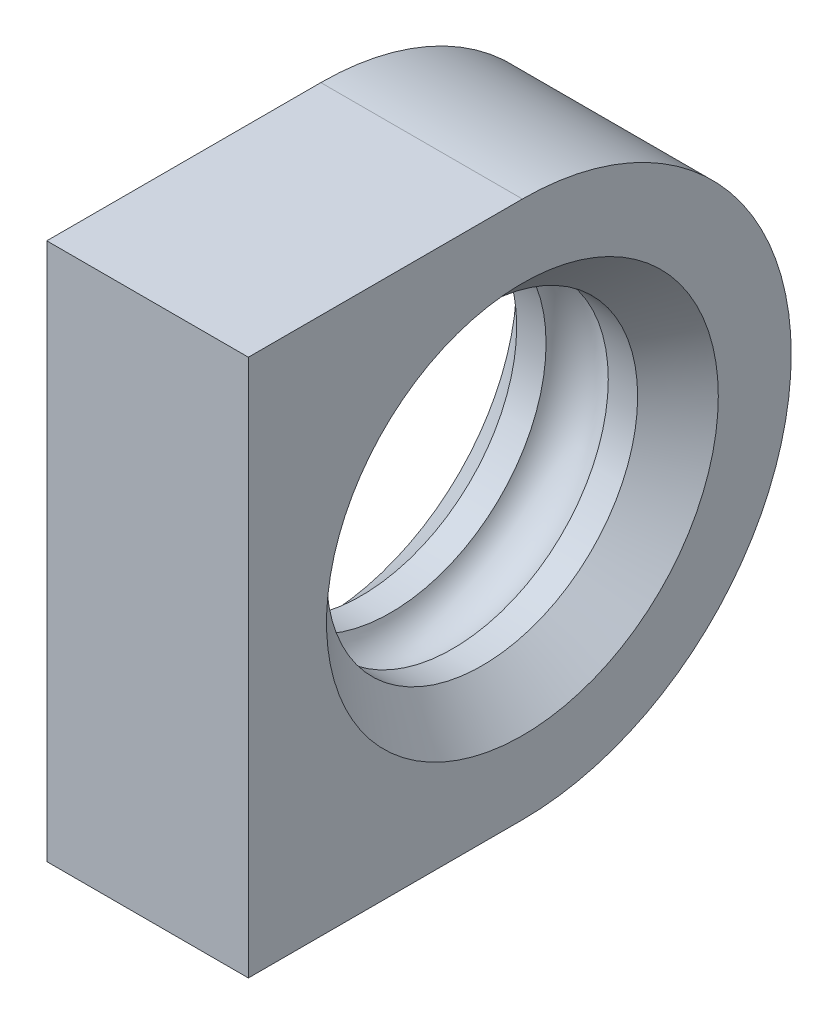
from build123d import *

# Parameters (mm, degrees)
SKETCH1_R               = 3.675
BOSS_EXTRUDE1_DEPTH     = 4.7625
CHAMFER1_SIZE           = 0.9525
SKETCH2_R               = 0.79375
SKETCH4_W               = 0.915865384
SKETCH4_H               = 0.244230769
SKETCH4_W_2             = 0.915865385
BOSS_EXTRUDE2_DEPTH     = 0.2
CUT_EXTRUDE3_DEPTH      = 57.906295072
CUT_EXTRUDE3_DEPTH_BACK = 57.906295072
SKETCH5_W               = 69.568425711
SKETCH5_H               = 50.937494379


with BuildPart() as part:
    # Sketch1 → Boss-Extrude1 (new body)
    with BuildSketch(Plane(origin=(0, 0, 0), x_dir=(0, 0, -1), z_dir=(1, 0, 0))):
        with BuildLine():
            Line((0, 6.35), (50, 6.35))
            ThreePointArc((50, 6.35), (56.35, 0), (50, -6.35))
            Line((50, -6.35), (0, -6.35))
            ThreePointArc((0, -6.35), (-6.35, 0), (0, 6.35))
        make_face()
        with Locations(Location((0, 0, 0), (0, 0, 180))):
            Circle(SKETCH1_R, mode=Mode.SUBTRACT)
        with Locations(Location((50, 0, 0), (0, 0, 180))):
            Circle(SKETCH1_R, mode=Mode.SUBTRACT)
    extrude(amount=BOSS_EXTRUDE1_DEPTH)

    # Chamfer1
    chamfer1_edges = [part.edges().sort_by_distance(p)[0] for p in [
        (0, 0, -3.675),
        (0, 0, -53.675),
        (4.7625, 0, -3.675),
        (4.7625, 0, -53.675),
    ]]
    chamfer(chamfer1_edges, length=CHAMFER1_SIZE)

    # Sketch2 → Cut-Revolve1 (revolve, cut)
    with BuildSketch(Plane(origin=(0, 0, 0), x_dir=(1, 0, 0), z_dir=(0, 1, 0))):
        with Locations((2.38125, -3.375)):
            Circle(SKETCH2_R)
    cut_revolve1 = revolve(axis=Axis((0.4525, 0, 0), (1, 0, 0)), mode=Mode.SUBTRACT)

    # Sketch-Pattern2: Cut-Revolve1 at 1 more place
    with Locations((0, 0, -50)):
        add(cut_revolve1, mode=Mode.SUBTRACT)

    # Sketch4 → Boss-Extrude2 (add)
    # profile 1 of 12: a face of its own
    with BuildSketch(Plane.ZY):
        Polygon((-33.757883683, -1.001090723), (-33.757883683, -1.235781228), (-35.406441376, -0.451571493), (-35.406441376, -0.279846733), (-33.757883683, 0.504363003), (-33.757883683, 0.269672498), (-35.093997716, -0.365709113), align=None)
    # profile 2 of 12: a face of its own
    with BuildSketch(Plane.ZY):
        with Locations((-33.055720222, -0.625204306)):
            Rectangle(SKETCH4_W, SKETCH4_H)
    # profile 3 of 12: a face of its own
    with BuildSketch(Plane.ZY):
        with Locations((-31.956681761, -0.625204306)):
            Rectangle(SKETCH4_W_2, SKETCH4_H)
    # profile 4 of 12: a face of its own
    with BuildSketch(Plane.ZY):
        with Locations((-30.857643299, -0.625204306)):
            Rectangle(SKETCH4_W_2, SKETCH4_H)
    # profile 5 of 12: a face of its own
    with BuildSketch(Plane.ZY):
        with BuildLine():
            Line((-28.720624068, 0.84018031), (-28.720624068, 0.595949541))
            Line((-28.720624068, 0.595949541), (-29.530115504, 0.595949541))
            Line((-29.530115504, 0.595949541), (-29.658909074, -0.030368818))
            add(Edge.make_bspline(
                [(-29.658909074, -0.030368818), (-29.633697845, -0.02340858), (-29.584855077, -0.009924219), (-29.512764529, 0.005047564), (-29.444325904, 0.014072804), (-29.39991534, 0.015305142), (-29.3784253, 0.015901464)],
                knots=[0, 0, 0, 0, 1.100273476, 2.13160584, 3.095893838, 4, 4, 4, 4], degree=3))
            add(Edge.make_bspline(
                [(-29.3784253, 0.015901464), (-29.351834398, 0.015325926), (-29.299550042, 0.014194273), (-29.223051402, 0.003327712), (-29.150026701, -0.013776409), (-29.08062866, -0.037670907), (-29.014728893, -0.068225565), (-28.952933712, -0.10639356), (-28.894315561, -0.15097963), (-28.839926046, -0.202241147), (-28.790583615, -0.258657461), (-28.747199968, -0.319316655), (-28.710350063, -0.383629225), (-28.680713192, -0.45220964), (-28.657047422, -0.524299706), (-28.641295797, -0.600657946), (-28.630806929, -0.680564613), (-28.629635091, -0.735200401), (-28.62903753, -0.763061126)],
                knots=[0, 0, 0, 0, 1.052922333, 2.070308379, 3.05430497, 4.020497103, 4.973039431, 5.925935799, 6.892292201, 7.88610001, 8.88166317, 9.857072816, 10.836096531, 11.812156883, 12.81219415, 13.836441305, 14.89672472, 16, 16, 16, 16], degree=3))
            add(Edge.make_bspline(
                [(-28.62903753, -0.763061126), (-28.629490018, -0.782466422), (-28.630388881, -0.821014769), (-28.63495992, -0.878262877), (-28.643760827, -0.934299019), (-28.655577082, -0.989130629), (-28.670913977, -1.042653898), (-28.68948028, -1.095022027), (-28.712201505, -1.145909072), (-28.737123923, -1.195796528), (-28.765186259, -1.243556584), (-28.796331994, -1.288221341), (-28.829237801, -1.330460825), (-28.864644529, -1.369822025), (-28.902881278, -1.406046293), (-28.94348497, -1.439348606), (-28.986131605, -1.470292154), (-29.031480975, -1.497620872), (-29.078522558, -1.522768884), (-29.127935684, -1.543399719), (-29.178595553, -1.56184456), (-29.231231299, -1.576546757), (-29.285723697, -1.588066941), (-29.342162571, -1.595891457), (-29.400251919, -1.601590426), (-29.439627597, -1.601947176), (-29.459517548, -1.602127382)],
                knots=[0, 0, 0, 0, 1.056347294, 2.098418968, 3.122841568, 4.141288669, 5.149314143, 6.15115421, 7.162517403, 8.180376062, 9.185164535, 10.17417709, 11.141909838, 12.097768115, 13.052685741, 14.0056014, 14.954263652, 15.917497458, 16.885230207, 17.854509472, 18.828990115, 19.81800267, 20.826176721, 21.857883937, 22.917946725, 24, 24, 24, 24], degree=3))
            add(Edge.make_bspline(
                [(-29.459517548, -1.602127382), (-29.483244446, -1.601657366), (-29.529924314, -1.600732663), (-29.5983142, -1.591059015), (-29.664114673, -1.577204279), (-29.726796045, -1.556360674), (-29.786920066, -1.530243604), (-29.843677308, -1.497235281), (-29.898518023, -1.459829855), (-29.94921282, -1.415688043), (-29.996263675, -1.367440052), (-30.038382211, -1.315081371), (-30.075892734, -1.259476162), (-30.108194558, -1.200354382), (-30.135747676, -1.137871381), (-30.15739323, -1.071793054), (-30.174863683, -1.002464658), (-30.182254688, -0.954735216), (-30.186008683, -0.930492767)],
                knots=[0, 0, 0, 0, 1.0467383, 2.05933395, 3.04377827, 4.011590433, 4.970194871, 5.932262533, 6.905835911, 7.896367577, 8.894135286, 9.877477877, 10.858688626, 11.851381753, 12.8477658, 13.868841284, 14.917554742, 16, 16, 16, 16], degree=3))
            Line((-30.186008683, -0.930492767), (-29.97230676, -0.930492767))
            add(Edge.make_bspline(
                [(-29.97230676, -0.930492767), (-29.967048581, -0.953200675), (-29.956942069, -0.996846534), (-29.934758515, -1.058168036), (-29.907635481, -1.112813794), (-29.875383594, -1.161506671), (-29.836909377, -1.203967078), (-29.793006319, -1.241806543), (-29.743784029, -1.275943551), (-29.689087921, -1.304397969), (-29.631384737, -1.32866546), (-29.570991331, -1.344825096), (-29.509552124, -1.356187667), (-29.467997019, -1.357325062), (-29.447115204, -1.357896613)],
                knots=[0, 0, 0, 0, 1.136247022, 2.183929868, 3.172523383, 4.106158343, 5.02341133, 5.958108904, 6.928429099, 7.938127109, 8.96079061, 9.975095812, 10.982467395, 12, 12, 12, 12], degree=3))
            add(Edge.make_bspline(
                [(-29.447115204, -1.357896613), (-29.426732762, -1.357338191), (-29.386599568, -1.356238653), (-29.327536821, -1.347775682), (-29.270514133, -1.334741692), (-29.216094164, -1.315235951), (-29.163324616, -1.291529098), (-29.113540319, -1.261106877), (-29.06530104, -1.226095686), (-29.020106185, -1.185984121), (-28.978713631, -1.141781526), (-28.94214027, -1.094512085), (-28.911675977, -1.044086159), (-28.886003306, -0.991376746), (-28.86650883, -0.935806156), (-28.852601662, -0.877634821), (-28.844435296, -0.816719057), (-28.843311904, -0.775170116), (-28.842739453, -0.753997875)],
                knots=[0, 0, 0, 0, 1.027316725, 2.022795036, 3.002884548, 3.971462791, 4.93288096, 5.914575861, 6.907176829, 7.935150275, 8.956128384, 9.956726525, 10.942570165, 11.921478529, 12.907843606, 13.90538589, 14.932640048, 16, 16, 16, 16], degree=3))
            add(Edge.make_bspline(
                [(-28.842739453, -0.753997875), (-28.843187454, -0.734896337), (-28.844064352, -0.697507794), (-28.851228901, -0.642807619), (-28.863690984, -0.591050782), (-28.880988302, -0.541987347), (-28.902949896, -0.495571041), (-28.929787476, -0.451753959), (-28.962004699, -0.411113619), (-28.998806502, -0.373631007), (-29.039123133, -0.339038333), (-29.083648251, -0.309548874), (-29.131450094, -0.284740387), (-29.181952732, -0.26333091), (-29.236357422, -0.247954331), (-29.293586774, -0.236410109), (-29.354258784, -0.229732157), (-29.395740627, -0.228805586), (-29.417063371, -0.228329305)],
                knots=[0, 0, 0, 0, 1.045622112, 2.046656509, 3.013763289, 3.955457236, 4.890082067, 5.820317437, 6.762574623, 7.722996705, 8.69280354, 9.665887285, 10.63943826, 11.638615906, 12.663482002, 13.728887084, 14.832589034, 16, 16, 16, 16], degree=3))
            add(Edge.make_bspline(
                [(-29.417063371, -0.228329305), (-29.435520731, -0.228724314), (-29.473630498, -0.229539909), (-29.532088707, -0.235545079), (-29.593519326, -0.245232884), (-29.657686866, -0.258558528), (-29.724784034, -0.275996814), (-29.794669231, -0.296893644), (-29.867489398, -0.321877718), (-29.916555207, -0.340745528), (-29.941777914, -0.35044469)],
                knots=[0, 0, 0, 0, 0.817624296, 1.688186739, 2.600797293, 3.572016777, 4.590301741, 5.671205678, 6.80286297, 8, 8, 8, 8], degree=3))
            Line((-29.941777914, -0.35044469), (-29.697547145, 0.84018031))
            Line((-29.697547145, 0.84018031), (-28.720624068, 0.84018031))
        make_face()
    # profile 6 of 12: a face of its own
    with BuildSketch(Plane.ZY):
        with BuildLine():
            add(Edge.make_bspline(
                [(-28.38480676, -0.351398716), (-28.384583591, -0.313232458), (-28.384150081, -0.239093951), (-28.379327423, -0.131063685), (-28.371315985, -0.029717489), (-28.360336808, 0.06494949), (-28.346975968, 0.152961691), (-28.329140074, 0.234083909), (-28.308856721, 0.308691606), (-28.285348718, 0.377028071), (-28.258823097, 0.440013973), (-28.229952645, 0.498813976), (-28.197591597, 0.553339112), (-28.163589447, 0.604459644), (-28.126569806, 0.651338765), (-28.087586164, 0.694638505), (-28.045116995, 0.733358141), (-28.000605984, 0.768632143), (-27.953650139, 0.799554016), (-27.905587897, 0.826790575), (-27.856088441, 0.850058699), (-27.805016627, 0.868353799), (-27.752831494, 0.883465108), (-27.699350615, 0.893799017), (-27.644485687, 0.900301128), (-27.607452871, 0.900922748), (-27.588671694, 0.901238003)],
                knots=[0, 0, 0, 0, 1.646270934, 3.197905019, 4.663502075, 6.030701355, 7.308322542, 8.50163776, 9.611534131, 10.641858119, 11.616356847, 12.558055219, 13.465016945, 14.349605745, 15.204443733, 16.039544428, 16.859896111, 17.680448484, 18.487036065, 19.28249412, 20.06191084, 20.843045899, 21.620316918, 22.403196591, 23.190181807, 24, 24, 24, 24], degree=3))
            add(Edge.make_bspline(
                [(-27.588671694, 0.901238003), (-27.569733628, 0.900906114), (-27.532071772, 0.900246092), (-27.476391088, 0.893902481), (-27.421996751, 0.883376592), (-27.36912066, 0.8684625), (-27.317328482, 0.849959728), (-27.267025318, 0.826768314), (-27.217898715, 0.799772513), (-27.170729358, 0.768051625), (-27.124999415, 0.732685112), (-27.08183214, 0.692705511), (-27.041223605, 0.648516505), (-27.002664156, 0.60059088), (-26.967247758, 0.548009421), (-26.93352012, 0.49168666), (-26.903331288, 0.430637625), (-26.874256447, 0.365880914), (-26.849160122, 0.295624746), (-26.826527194, 0.22026515), (-26.808239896, 0.138911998), (-26.793007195, 0.051992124), (-26.781206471, -0.040813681), (-26.772611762, -0.139306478), (-26.768071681, -0.243551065), (-26.767216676, -0.314823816), (-26.766777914, -0.351398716)],
                knots=[0, 0, 0, 0, 0.810914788, 1.612654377, 2.396697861, 3.181598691, 3.963628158, 4.749916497, 5.551656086, 6.361998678, 7.18212741, 8.025565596, 8.878627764, 9.750805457, 10.657531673, 11.591944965, 12.560506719, 13.57287815, 14.630710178, 15.753379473, 16.941251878, 18.199788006, 19.531962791, 20.947069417, 22.433333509, 24, 24, 24, 24], degree=3))
            add(Edge.make_bspline(
                [(-26.766777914, -0.351398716), (-26.767221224, -0.387814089), (-26.768084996, -0.458767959), (-26.772560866, -0.562543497), (-26.781377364, -0.660513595), (-26.792405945, -0.752913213), (-26.807680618, -0.839357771), (-26.82646199, -0.920146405), (-26.847315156, -0.995627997), (-26.873056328, -1.065184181), (-26.901230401, -1.129785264), (-26.931884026, -1.190110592), (-26.964724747, -1.246693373), (-27.000503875, -1.299080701), (-27.038640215, -1.34764368), (-27.079949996, -1.391525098), (-27.123268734, -1.431782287), (-27.169133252, -1.467604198), (-27.217038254, -1.498958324), (-27.265996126, -1.526998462), (-27.316875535, -1.549608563), (-27.368523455, -1.569022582), (-27.421678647, -1.583854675), (-27.476274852, -1.594110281), (-27.532034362, -1.601302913), (-27.569727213, -1.601851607), (-27.588671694, -1.602127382)],
                knots=[0, 0, 0, 0, 1.561518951, 3.042555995, 4.452378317, 5.7783523, 7.031515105, 8.214008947, 9.334062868, 10.386615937, 11.391082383, 12.354592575, 13.286541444, 14.194233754, 15.072674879, 15.931287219, 16.775624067, 17.606195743, 18.42308326, 19.229000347, 20.022332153, 20.807536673, 21.593273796, 22.3848459, 23.188221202, 24, 24, 24, 24], degree=3))
            add(Edge.make_bspline(
                [(-27.588671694, -1.602127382), (-27.60745235, -1.601810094), (-27.644484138, -1.601184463), (-27.699356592, -1.594711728), (-27.752616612, -1.584305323), (-27.804527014, -1.569734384), (-27.855354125, -1.551898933), (-27.904405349, -1.52866223), (-27.952226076, -1.501901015), (-27.998688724, -1.47142413), (-28.042920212, -1.436507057), (-28.085169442, -1.397887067), (-28.124375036, -1.354600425), (-28.160865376, -1.307330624), (-28.195545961, -1.256512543), (-28.227447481, -1.201452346), (-28.256955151, -1.142368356), (-28.283926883, -1.078878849), (-28.307840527, -1.010057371), (-28.328964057, -0.935116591), (-28.345642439, -0.85339506), (-28.359918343, -0.765549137), (-28.371432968, -0.671201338), (-28.379294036, -0.570300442), (-28.38415268, -0.462909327), (-28.384584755, -0.389247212), (-28.38480676, -0.351398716)],
                knots=[0, 0, 0, 0, 0.810891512, 1.598919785, 2.382837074, 3.152667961, 3.926044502, 4.706494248, 5.493654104, 6.291793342, 7.103789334, 7.925228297, 8.761435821, 9.622817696, 10.50288917, 11.416980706, 12.369136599, 13.353924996, 14.394355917, 15.514179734, 16.714354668, 17.994756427, 19.357759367, 20.818452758, 22.365282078, 24, 24, 24, 24], degree=3))
        make_face()
        with BuildLine():
            add(Edge.make_bspline(
                [(-28.171104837, -0.35044469), (-28.171023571, -0.382250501), (-28.170865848, -0.443979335), (-28.166745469, -0.533679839), (-28.161132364, -0.617343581), (-28.153892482, -0.695076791), (-28.143140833, -0.766616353), (-28.131093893, -0.832454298), (-28.116433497, -0.892242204), (-28.099087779, -0.946390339), (-28.079330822, -0.995817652), (-28.057759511, -1.041810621), (-28.034586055, -1.084912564), (-28.008651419, -1.124736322), (-27.980406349, -1.161411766), (-27.950488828, -1.195588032), (-27.917782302, -1.226065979), (-27.872536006, -1.262619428), (-27.812803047, -1.300392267), (-27.73754163, -1.333284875), (-27.660206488, -1.353955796), (-27.607716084, -1.35658453), (-27.581516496, -1.357896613)],
                knots=[0, 0, 0, 0, 1.459021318, 2.831673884, 4.118529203, 5.306027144, 6.411944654, 7.436330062, 8.375795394, 9.233974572, 10.042671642, 10.816086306, 11.563610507, 12.285937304, 12.993564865, 13.685989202, 14.367179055, 15.041617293, 16.353048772, 17.594441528, 18.799311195, 20, 20, 20, 20], degree=3))
            add(Edge.make_bspline(
                [(-27.581516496, -1.357896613), (-27.555147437, -1.356809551), (-27.502463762, -1.354637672), (-27.425492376, -1.333683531), (-27.350768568, -1.302067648), (-27.292208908, -1.264683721), (-27.247657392, -1.229081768), (-27.215737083, -1.198727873), (-27.18643951, -1.164740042), (-27.158652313, -1.128069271), (-27.133166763, -1.088014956), (-27.109991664, -1.044769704), (-27.088843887, -0.998213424), (-27.076795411, -0.965712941), (-27.070635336, -0.949096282)],
                knots=[0, 0, 0, 0, 1.353760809, 2.704726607, 4.075137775, 5.516104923, 6.260822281, 7.007110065, 7.778089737, 8.566572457, 9.372053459, 10.217411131, 11.088608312, 12, 12, 12, 12], degree=3))
            add(Edge.make_bspline(
                [(-27.070635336, -0.949096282), (-27.063456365, -0.927848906), (-27.048879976, -0.88470762), (-27.030094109, -0.817785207), (-27.015299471, -0.747570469), (-27.001989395, -0.674483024), (-26.992904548, -0.59798387), (-26.985592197, -0.518309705), (-26.981285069, -0.435400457), (-26.980751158, -0.379070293), (-26.980479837, -0.35044469)],
                knots=[0, 0, 0, 0, 0.884706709, 1.796334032, 2.740027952, 3.714592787, 4.726048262, 5.777819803, 6.87074269, 8, 8, 8, 8], degree=3))
            add(Edge.make_bspline(
                [(-26.980479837, -0.35044469), (-26.980854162, -0.321823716), (-26.981586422, -0.265834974), (-26.984385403, -0.183839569), (-26.991613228, -0.10596061), (-26.999640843, -0.031862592), (-27.011477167, 0.03804431), (-27.024239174, 0.104345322), (-27.041384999, 0.166219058), (-27.05970006, 0.224634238), (-27.080662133, 0.278927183), (-27.103736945, 0.329351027), (-27.128380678, 0.376149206), (-27.155147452, 0.419193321), (-27.183719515, 0.458676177), (-27.21485099, 0.493806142), (-27.247307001, 0.525672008), (-27.292766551, 0.562045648), (-27.352280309, 0.59913307), (-27.426334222, 0.633263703), (-27.503398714, 0.65286363), (-27.55549601, 0.655627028), (-27.581516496, 0.657007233)],
                knots=[0, 0, 0, 0, 1.31362396, 2.569729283, 3.763502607, 4.902122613, 5.988968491, 7.01645872, 7.998833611, 8.933434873, 9.825090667, 10.667526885, 11.477055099, 12.250526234, 12.991942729, 13.710640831, 14.402115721, 15.076753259, 16.378508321, 17.609869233, 18.806226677, 20, 20, 20, 20], degree=3))
            add(Edge.make_bspline(
                [(-27.581516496, 0.657007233), (-27.607853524, 0.655625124), (-27.660575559, 0.652858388), (-27.738441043, 0.633336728), (-27.813079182, 0.599310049), (-27.872435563, 0.56192281), (-27.917926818, 0.526314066), (-27.949959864, 0.495435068), (-27.979995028, 0.461657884), (-28.007663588, 0.424645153), (-28.033577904, 0.384867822), (-28.057377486, 0.342012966), (-28.078820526, 0.295863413), (-28.098608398, 0.246458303), (-28.116007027, 0.192314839), (-28.130358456, 0.132600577), (-28.143616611, 0.06697204), (-28.153002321, -0.004954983), (-28.161346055, -0.082707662), (-28.166708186, -0.166580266), (-28.170879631, -0.25643121), (-28.171028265, -0.318479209), (-28.171104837, -0.35044469)],
                knots=[0, 0, 0, 0, 1.207732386, 2.417664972, 3.655092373, 4.956220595, 5.625982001, 6.301752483, 6.994047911, 7.697131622, 8.419323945, 9.170223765, 9.943494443, 10.752040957, 11.610060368, 12.549350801, 13.567764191, 14.679664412, 15.874934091, 17.154273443, 18.533957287, 20, 20, 20, 20], degree=3))
        make_face(mode=Mode.SUBTRACT)
    # profile 7 of 12: a face of its own
    with BuildSketch(Plane.ZY):
        with BuildLine():
            Line((-26.40043176, 0.199074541), (-26.186729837, 0.199074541))
            Line((-26.186729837, 0.199074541), (-26.186729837, -0.103351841))
            add(Edge.make_bspline(
                [(-26.186729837, -0.103351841), (-26.16748665, -0.076894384), (-26.130614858, -0.026199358), (-26.070154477, 0.040605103), (-26.009755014, 0.097298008), (-25.966257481, 0.127058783), (-25.945361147, 0.141355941)],
                knots=[0, 0, 0, 0, 1.134379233, 2.173579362, 3.122582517, 4, 4, 4, 4], degree=3))
            add(Edge.make_bspline(
                [(-25.945361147, 0.141355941), (-25.916878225, 0.154966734), (-25.860410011, 0.181950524), (-25.770998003, 0.209323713), (-25.679507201, 0.226145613), (-25.617725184, 0.228446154), (-25.586647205, 0.229603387)],
                knots=[0, 0, 0, 0, 1.014936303, 2.012140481, 3.000054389, 4, 4, 4, 4], degree=3))
            add(Edge.make_bspline(
                [(-25.586647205, 0.229603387), (-25.565628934, 0.228892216), (-25.524034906, 0.227484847), (-25.462405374, 0.218327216), (-25.402630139, 0.202497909), (-25.34506238, 0.180449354), (-25.290823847, 0.153747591), (-25.241097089, 0.122417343), (-25.19644919, 0.087244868), (-25.156902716, 0.04664188), (-25.121341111, -0.00053177), (-25.088630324, -0.055548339), (-25.058405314, -0.119643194), (-25.04165403, -0.166156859), (-25.032834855, -0.190645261)],
                knots=[0, 0, 0, 0, 1.009824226, 1.998387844, 2.986035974, 3.974953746, 4.955485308, 5.885931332, 6.793869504, 7.679848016, 8.601185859, 9.625726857, 10.749998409, 12, 12, 12, 12], degree=3))
            add(Edge.make_bspline(
                [(-25.032834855, -0.190645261), (-25.023506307, -0.173823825), (-25.005149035, -0.140721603), (-24.974325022, -0.093873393), (-24.942029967, -0.050053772), (-24.907988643, -0.009227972), (-24.8723212, 0.028402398), (-24.834859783, 0.062961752), (-24.795817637, 0.094598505), (-24.741530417, 0.131557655), (-24.670900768, 0.170815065), (-24.581850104, 0.204852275), (-24.489219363, 0.225886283), (-24.426342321, 0.228356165), (-24.394591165, 0.229603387)],
                knots=[0, 0, 0, 0, 0.86119277, 1.694706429, 2.50939023, 3.298075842, 4.073795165, 4.829715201, 5.57930267, 6.321991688, 7.768977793, 9.186738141, 10.579381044, 12, 12, 12, 12], degree=3))
            add(Edge.make_bspline(
                [(-24.394591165, 0.229603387), (-24.365416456, 0.228503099), (-24.308318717, 0.226349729), (-24.225194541, 0.209440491), (-24.14767342, 0.180404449), (-24.075911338, 0.140784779), (-24.011168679, 0.090996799), (-23.954892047, 0.031758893), (-23.907423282, -0.036509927), (-23.876413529, -0.100730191), (-23.855380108, -0.15742798), (-23.842411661, -0.205737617), (-23.830954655, -0.258908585), (-23.821442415, -0.317004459), (-23.81449015, -0.380230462), (-23.809339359, -0.448483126), (-23.805853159, -0.521815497), (-23.805606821, -0.572410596), (-23.805479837, -0.598491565)],
                knots=[0, 0, 0, 0, 1.209669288, 2.367440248, 3.500751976, 4.631527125, 5.755587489, 6.87532382, 8.007944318, 9.190864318, 9.82315674, 10.514484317, 11.263564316, 12.079023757, 12.955305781, 13.901327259, 14.918167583, 16, 16, 16, 16], degree=3))
            Line((-23.805479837, -0.598491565), (-23.805479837, -1.54106969))
            Line((-23.805479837, -1.54106969), (-24.01918176, -1.54106969))
            Line((-24.01918176, -1.54106969), (-24.01918176, -0.597537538))
            add(Edge.make_bspline(
                [(-24.01918176, -0.597537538), (-24.019234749, -0.575275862), (-24.019336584, -0.532492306), (-24.021169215, -0.471088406), (-24.024622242, -0.415116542), (-24.028659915, -0.364653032), (-24.03426865, -0.319580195), (-24.041511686, -0.279988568), (-24.049184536, -0.245566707), (-24.061931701, -0.207408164), (-24.082306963, -0.165314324), (-24.113343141, -0.119918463), (-24.152443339, -0.080402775), (-24.197591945, -0.046100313), (-24.248991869, -0.018209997), (-24.305641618, 0.001708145), (-24.367189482, 0.014038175), (-24.409795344, 0.015266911), (-24.431798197, 0.015901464)],
                knots=[0, 0, 0, 0, 1.253487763, 2.409012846, 3.458416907, 4.410876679, 5.259312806, 6.014470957, 6.676830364, 7.243083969, 8.276244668, 9.299465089, 10.325150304, 11.392391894, 12.482080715, 13.603491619, 14.762376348, 16, 16, 16, 16], degree=3))
            add(Edge.make_bspline(
                [(-24.431798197, 0.015901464), (-24.458787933, 0.014937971), (-24.512129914, 0.013033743), (-24.589993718, -0.006406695), (-24.664813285, -0.035716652), (-24.734356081, -0.07819302), (-24.798328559, -0.129089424), (-24.853369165, -0.189606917), (-24.89883892, -0.258071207), (-24.929627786, -0.321444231), (-24.949078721, -0.378369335), (-24.961921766, -0.428101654), (-24.971911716, -0.484626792), (-24.981280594, -0.547564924), (-24.987395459, -0.617349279), (-24.992952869, -0.693657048), (-24.99555242, -0.776717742), (-24.995916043, -0.834294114), (-24.996104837, -0.864187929)],
                knots=[0, 0, 0, 0, 1.090531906, 2.155305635, 3.229839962, 4.33261226, 5.44038871, 6.529323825, 7.629011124, 8.757537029, 9.370236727, 10.061839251, 10.834451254, 11.692844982, 12.636905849, 13.66920014, 14.789842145, 16, 16, 16, 16], degree=3))
            Line((-24.996104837, -0.864187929), (-24.996104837, -1.54106969))
            Line((-24.996104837, -1.54106969), (-25.20980676, -1.54106969))
            Line((-25.20980676, -1.54106969), (-25.20980676, -0.656210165))
            add(Edge.make_bspline(
                [(-25.20980676, -0.656210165), (-25.209860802, -0.631245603), (-25.209964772, -0.583216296), (-25.211785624, -0.514341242), (-25.215246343, -0.451693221), (-25.219247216, -0.395345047), (-25.225003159, -0.345399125), (-25.231541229, -0.301587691), (-25.239262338, -0.26402058), (-25.25204617, -0.222815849), (-25.271582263, -0.177421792), (-25.303006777, -0.12902049), (-25.342200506, -0.086655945), (-25.388172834, -0.050489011), (-25.439883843, -0.020593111), (-25.49702255, 0.000946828), (-25.559074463, 0.013481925), (-25.60185376, 0.015079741), (-25.623854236, 0.015901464)],
                knots=[0, 0, 0, 0, 1.320475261, 2.540461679, 3.643808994, 4.639130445, 5.527981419, 6.302341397, 6.981980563, 7.553956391, 8.582137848, 9.585246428, 10.591171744, 11.620968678, 12.668337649, 13.738356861, 14.836885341, 16, 16, 16, 16], degree=3))
            add(Edge.make_bspline(
                [(-25.623854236, 0.015901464), (-25.649718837, 0.014860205), (-25.701266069, 0.012785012), (-25.776991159, -0.0058937), (-25.850119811, -0.035151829), (-25.919485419, -0.075741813), (-25.983217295, -0.126019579), (-26.039012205, -0.185152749), (-26.085917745, -0.252405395), (-26.117031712, -0.315110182), (-26.137101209, -0.370609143), (-26.150433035, -0.417792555), (-26.161889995, -0.470180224), (-26.170403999, -0.527933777), (-26.178622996, -0.590677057), (-26.182589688, -0.658722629), (-26.186448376, -0.732012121), (-26.186633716, -0.782612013), (-26.186729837, -0.808854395)],
                knots=[0, 0, 0, 0, 1.098833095, 2.189935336, 3.297829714, 4.440610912, 5.596351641, 6.740013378, 7.886572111, 9.072425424, 9.705826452, 10.395263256, 11.156850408, 11.985370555, 12.878090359, 13.847760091, 14.883794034, 16, 16, 16, 16], degree=3))
            Line((-26.186729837, -0.808854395), (-26.186729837, -1.54106969))
            Line((-26.186729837, -1.54106969), (-26.40043176, -1.54106969))
            Line((-26.40043176, -1.54106969), (-26.40043176, 0.199074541))
        make_face()
    # profile 8 of 12: a face of its own
    with BuildSketch(Plane.ZY):
        with BuildLine():
            Line((-23.317018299, 0.199074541), (-23.103316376, 0.199074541))
            Line((-23.103316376, 0.199074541), (-23.103316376, -0.103351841))
            add(Edge.make_bspline(
                [(-23.103316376, -0.103351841), (-23.084073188, -0.076894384), (-23.047201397, -0.026199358), (-22.986741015, 0.040605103), (-22.926341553, 0.097298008), (-22.88284402, 0.127058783), (-22.861947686, 0.141355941)],
                knots=[0, 0, 0, 0, 1.134379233, 2.173579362, 3.122582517, 4, 4, 4, 4], degree=3))
            add(Edge.make_bspline(
                [(-22.861947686, 0.141355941), (-22.833464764, 0.154966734), (-22.77699655, 0.181950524), (-22.687584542, 0.209323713), (-22.59609374, 0.226145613), (-22.534311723, 0.228446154), (-22.503233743, 0.229603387)],
                knots=[0, 0, 0, 0, 1.014936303, 2.012140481, 3.000054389, 4, 4, 4, 4], degree=3))
            add(Edge.make_bspline(
                [(-22.503233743, 0.229603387), (-22.482215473, 0.228892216), (-22.440621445, 0.227484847), (-22.378991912, 0.218327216), (-22.319216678, 0.202497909), (-22.261648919, 0.180449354), (-22.207410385, 0.153747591), (-22.157683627, 0.122417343), (-22.113035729, 0.087244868), (-22.073489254, 0.04664188), (-22.03792765, -0.00053177), (-22.005216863, -0.055548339), (-21.974991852, -0.119643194), (-21.958240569, -0.166156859), (-21.949421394, -0.190645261)],
                knots=[0, 0, 0, 0, 1.009824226, 1.998387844, 2.986035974, 3.974953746, 4.955485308, 5.885931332, 6.793869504, 7.679848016, 8.601185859, 9.625726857, 10.749998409, 12, 12, 12, 12], degree=3))
            add(Edge.make_bspline(
                [(-21.949421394, -0.190645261), (-21.940092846, -0.173823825), (-21.921735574, -0.140721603), (-21.89091156, -0.093873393), (-21.858616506, -0.050053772), (-21.824575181, -0.009227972), (-21.788907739, 0.028402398), (-21.751446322, 0.062961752), (-21.712404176, 0.094598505), (-21.658116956, 0.131557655), (-21.587487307, 0.170815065), (-21.498436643, 0.204852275), (-21.405805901, 0.225886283), (-21.34292886, 0.228356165), (-21.311177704, 0.229603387)],
                knots=[0, 0, 0, 0, 0.86119277, 1.694706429, 2.50939023, 3.298075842, 4.073795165, 4.829715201, 5.57930267, 6.321991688, 7.768977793, 9.186738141, 10.579381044, 12, 12, 12, 12], degree=3))
            add(Edge.make_bspline(
                [(-21.311177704, 0.229603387), (-21.282002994, 0.228503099), (-21.224905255, 0.226349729), (-21.14178108, 0.209440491), (-21.064259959, 0.180404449), (-20.992497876, 0.140784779), (-20.927755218, 0.090996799), (-20.871478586, 0.031758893), (-20.824009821, -0.036509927), (-20.793000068, -0.100730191), (-20.771966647, -0.15742798), (-20.7589982, -0.205737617), (-20.747541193, -0.258908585), (-20.738028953, -0.317004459), (-20.731076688, -0.380230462), (-20.725925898, -0.448483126), (-20.722439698, -0.521815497), (-20.722193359, -0.572410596), (-20.722066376, -0.598491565)],
                knots=[0, 0, 0, 0, 1.209669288, 2.367440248, 3.500751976, 4.631527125, 5.755587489, 6.87532382, 8.007944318, 9.190864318, 9.82315674, 10.514484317, 11.263564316, 12.079023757, 12.955305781, 13.901327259, 14.918167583, 16, 16, 16, 16], degree=3))
            Line((-20.722066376, -0.598491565), (-20.722066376, -1.54106969))
            Line((-20.722066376, -1.54106969), (-20.935768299, -1.54106969))
            Line((-20.935768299, -1.54106969), (-20.935768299, -0.597537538))
            add(Edge.make_bspline(
                [(-20.935768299, -0.597537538), (-20.935821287, -0.575275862), (-20.935923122, -0.532492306), (-20.937755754, -0.471088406), (-20.94120878, -0.415116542), (-20.945246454, -0.364653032), (-20.950855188, -0.319580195), (-20.958098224, -0.279988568), (-20.965771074, -0.245566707), (-20.97851824, -0.207408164), (-20.998893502, -0.165314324), (-21.02992968, -0.119918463), (-21.069029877, -0.080402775), (-21.114178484, -0.046100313), (-21.165578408, -0.018209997), (-21.222228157, 0.001708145), (-21.283776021, 0.014038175), (-21.326381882, 0.015266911), (-21.348384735, 0.015901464)],
                knots=[0, 0, 0, 0, 1.253487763, 2.409012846, 3.458416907, 4.410876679, 5.259312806, 6.014470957, 6.676830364, 7.243083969, 8.276244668, 9.299465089, 10.325150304, 11.392391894, 12.482080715, 13.603491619, 14.762376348, 16, 16, 16, 16], degree=3))
            add(Edge.make_bspline(
                [(-21.348384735, 0.015901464), (-21.375374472, 0.014937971), (-21.428716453, 0.013033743), (-21.506580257, -0.006406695), (-21.581399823, -0.035716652), (-21.650942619, -0.07819302), (-21.714915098, -0.129089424), (-21.769955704, -0.189606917), (-21.815425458, -0.258071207), (-21.846214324, -0.321444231), (-21.86566526, -0.378369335), (-21.878508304, -0.428101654), (-21.888498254, -0.484626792), (-21.897867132, -0.547564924), (-21.903981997, -0.617349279), (-21.909539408, -0.693657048), (-21.912138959, -0.776717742), (-21.912502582, -0.834294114), (-21.912691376, -0.864187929)],
                knots=[0, 0, 0, 0, 1.090531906, 2.155305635, 3.229839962, 4.33261226, 5.44038871, 6.529323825, 7.629011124, 8.757537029, 9.370236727, 10.061839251, 10.834451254, 11.692844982, 12.636905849, 13.66920014, 14.789842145, 16, 16, 16, 16], degree=3))
            Line((-21.912691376, -0.864187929), (-21.912691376, -1.54106969))
            Line((-21.912691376, -1.54106969), (-22.126393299, -1.54106969))
            Line((-22.126393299, -1.54106969), (-22.126393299, -0.656210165))
            add(Edge.make_bspline(
                [(-22.126393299, -0.656210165), (-22.12644734, -0.631245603), (-22.12655131, -0.583216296), (-22.128372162, -0.514341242), (-22.131832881, -0.451693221), (-22.135833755, -0.395345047), (-22.141589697, -0.345399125), (-22.148127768, -0.301587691), (-22.155848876, -0.26402058), (-22.168632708, -0.222815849), (-22.188168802, -0.177421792), (-22.219593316, -0.12902049), (-22.258787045, -0.086655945), (-22.304759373, -0.050489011), (-22.356470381, -0.020593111), (-22.413609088, 0.000946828), (-22.475661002, 0.013481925), (-22.518440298, 0.015079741), (-22.540440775, 0.015901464)],
                knots=[0, 0, 0, 0, 1.320475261, 2.540461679, 3.643808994, 4.639130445, 5.527981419, 6.302341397, 6.981980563, 7.553956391, 8.582137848, 9.585246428, 10.591171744, 11.620968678, 12.668337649, 13.738356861, 14.836885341, 16, 16, 16, 16], degree=3))
            add(Edge.make_bspline(
                [(-22.540440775, 0.015901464), (-22.566305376, 0.014860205), (-22.617852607, 0.012785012), (-22.693577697, -0.0058937), (-22.76670635, -0.035151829), (-22.836071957, -0.075741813), (-22.899803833, -0.126019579), (-22.955598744, -0.185152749), (-23.002504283, -0.252405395), (-23.03361825, -0.315110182), (-23.053687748, -0.370609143), (-23.067019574, -0.417792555), (-23.078476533, -0.470180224), (-23.086990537, -0.527933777), (-23.095209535, -0.590677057), (-23.099176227, -0.658722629), (-23.103034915, -0.732012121), (-23.103220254, -0.782612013), (-23.103316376, -0.808854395)],
                knots=[0, 0, 0, 0, 1.098833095, 2.189935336, 3.297829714, 4.440610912, 5.596351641, 6.740013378, 7.886572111, 9.072425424, 9.705826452, 10.395263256, 11.156850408, 11.985370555, 12.878090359, 13.847760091, 14.883794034, 16, 16, 16, 16], degree=3))
            Line((-23.103316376, -0.808854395), (-23.103316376, -1.54106969))
            Line((-23.103316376, -1.54106969), (-23.317018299, -1.54106969))
            Line((-23.317018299, -1.54106969), (-23.317018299, 0.199074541))
        make_face()
    # profile 9 of 12: a face of its own
    with BuildSketch(Plane.ZY):
        with Locations((-19.928316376, -0.625204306)):
            Rectangle(SKETCH4_W_2, SKETCH4_H)
    # profile 10 of 12: a face of its own
    with BuildSketch(Plane.ZY):
        with Locations((-18.829277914, -0.625204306)):
            Rectangle(SKETCH4_W, SKETCH4_H)
    # profile 11 of 12: a face of its own
    with BuildSketch(Plane.ZY):
        with Locations((-17.730239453, -0.625204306)):
            Rectangle(SKETCH4_W_2, SKETCH4_H)
    # profile 12 of 12: a face of its own
    with BuildSketch(Plane.ZY):
        Polygon((-16.997547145, -1.00347579), (-15.660956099, -0.365709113), (-16.997547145, 0.272057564), (-16.997547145, 0.504363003), (-15.348989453, -0.282231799), (-15.348989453, -0.449186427), (-16.997547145, -1.235781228), align=None)
    extrude(amount=BOSS_EXTRUDE2_DEPTH)

    # Sketch5 → Cut-Extrude3 (cut, two sides: drawn at the far end of the back side and taken through both)
    with BuildSketch(Plane.ZY.offset(-CUT_EXTRUDE3_DEPTH_BACK)):
        with Locations((-8.742605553, 1.3007808)):
            Rectangle(SKETCH5_W, SKETCH5_H)
    extrude(amount=CUT_EXTRUDE3_DEPTH + CUT_EXTRUDE3_DEPTH_BACK, mode=Mode.SUBTRACT)


solid = part.part
